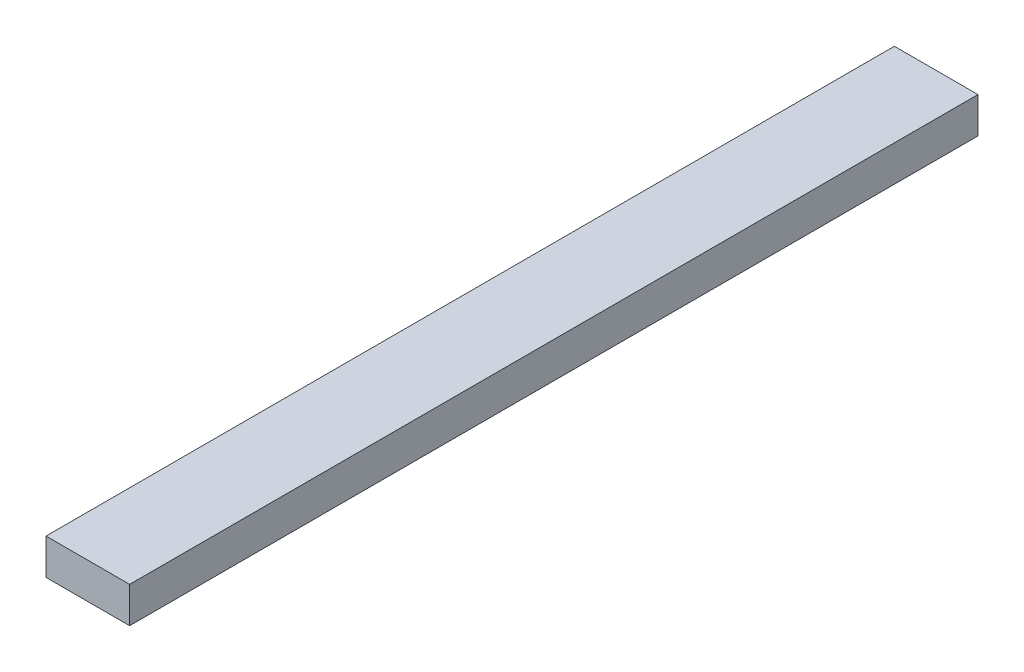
ISO-10303-21;
HEADER;
FILE_DESCRIPTION(('STEP AP214'),'2;1');
FILE_NAME('part.step','',(''),(''),'','','');
FILE_SCHEMA(('AUTOMOTIVE_DESIGN { 1 0 10303 214 1 1 1 1 }'));
ENDSEC;
DATA;
#1=APPLICATION_CONTEXT('core data for automotive mechanical design processes');
#2=APPLICATION_PROTOCOL_DEFINITION('international standard','automotive_design',2000,#1);
#3=PRODUCT_CONTEXT('',#1,'mechanical');
#4=PRODUCT('Part','Part','',(#3));
#5=PRODUCT_RELATED_PRODUCT_CATEGORY('part','',(#4));
#6=PRODUCT_DEFINITION_FORMATION('','',#4);
#7=PRODUCT_DEFINITION_CONTEXT('part definition',#1,'design');
#8=PRODUCT_DEFINITION('design','',#6,#7);
#9=PRODUCT_DEFINITION_SHAPE('','',#8);
#10=(LENGTH_UNIT() NAMED_UNIT(*) SI_UNIT(.MILLI.,.METRE.));
#11=(NAMED_UNIT(*) PLANE_ANGLE_UNIT() SI_UNIT($,.RADIAN.));
#12=(NAMED_UNIT(*) SI_UNIT($,.STERADIAN.) SOLID_ANGLE_UNIT());
#13=UNCERTAINTY_MEASURE_WITH_UNIT(LENGTH_MEASURE(1.E-05),#10,'distance_accuracy_value','');
#14=(GEOMETRIC_REPRESENTATION_CONTEXT(3) GLOBAL_UNCERTAINTY_ASSIGNED_CONTEXT((#13)) GLOBAL_UNIT_ASSIGNED_CONTEXT((#10,
#11,#12)) REPRESENTATION_CONTEXT('',''));
#15=CARTESIAN_POINT('',(0.,0.,0.));
#16=DIRECTION('',(0.,0.,1.));
#17=DIRECTION('',(1.,0.,0.));
#18=AXIS2_PLACEMENT_3D('',#15,#16,#17);
#19=CARTESIAN_POINT('',(-88.9,38.1,0.));
#20=DIRECTION('',(0.,0.,1.));
#21=DIRECTION('',(1.,0.,0.));
#22=AXIS2_PLACEMENT_3D('',#19,#20,#21);
#23=PLANE('',#22);
#24=DIRECTION('',(-1.,0.,0.));
#25=VECTOR('',#24,1.);
#26=CARTESIAN_POINT('',(-88.9,0.,0.));
#27=LINE('',#26,#25);
#28=CARTESIAN_POINT('',(0.,0.,0.));
#29=VERTEX_POINT('',#28);
#30=CARTESIAN_POINT('',(-88.9,0.,0.));
#31=VERTEX_POINT('',#30);
#32=EDGE_CURVE('E96',#29,#31,#27,.T.);
#33=ORIENTED_EDGE('',*,*,#32,.T.);
#34=DIRECTION('',(0.,-1.,0.));
#35=VECTOR('',#34,1.);
#36=CARTESIAN_POINT('',(-88.9,38.1,0.));
#37=LINE('',#36,#35);
#38=CARTESIAN_POINT('',(-88.9,38.1,0.));
#39=VERTEX_POINT('',#38);
#40=EDGE_CURVE('E11',#39,#31,#37,.T.);
#41=ORIENTED_EDGE('',*,*,#40,.F.);
#42=DIRECTION('',(-1.,0.,0.));
#43=VECTOR('',#42,1.);
#44=CARTESIAN_POINT('',(-88.9,38.1,0.));
#45=LINE('',#44,#43);
#46=CARTESIAN_POINT('',(0.,38.1,0.));
#47=VERTEX_POINT('',#46);
#48=EDGE_CURVE('E84',#47,#39,#45,.T.);
#49=ORIENTED_EDGE('',*,*,#48,.F.);
#50=DIRECTION('',(0.,-1.,0.));
#51=VECTOR('',#50,1.);
#52=CARTESIAN_POINT('',(0.,38.1,0.));
#53=LINE('',#52,#51);
#54=EDGE_CURVE('E92',#47,#29,#53,.T.);
#55=ORIENTED_EDGE('',*,*,#54,.T.);
#56=EDGE_LOOP('',(#33,#41,#49,#55));
#57=FACE_BOUND('',#56,.T.);
#58=ADVANCED_FACE('F33',(#57),#23,.F.);
#59=CARTESIAN_POINT('',(-88.9,38.1,901.7));
#60=DIRECTION('',(1.,0.,0.));
#61=DIRECTION('',(0.,0.,-1.));
#62=AXIS2_PLACEMENT_3D('',#59,#60,#61);
#63=PLANE('',#62);
#64=DIRECTION('',(0.,0.,1.));
#65=VECTOR('',#64,1.);
#66=CARTESIAN_POINT('',(-88.9,0.,901.7));
#67=LINE('',#66,#65);
#68=CARTESIAN_POINT('',(-88.9,0.,901.7));
#69=VERTEX_POINT('',#68);
#70=EDGE_CURVE('E88',#31,#69,#67,.T.);
#71=ORIENTED_EDGE('',*,*,#70,.T.);
#72=DIRECTION('',(0.,-1.,0.));
#73=VECTOR('',#72,1.);
#74=CARTESIAN_POINT('',(-88.9,38.1,901.7));
#75=LINE('',#74,#73);
#76=CARTESIAN_POINT('',(-88.9,38.1,901.7));
#77=VERTEX_POINT('',#76);
#78=EDGE_CURVE('E41',#77,#69,#75,.T.);
#79=ORIENTED_EDGE('',*,*,#78,.F.);
#80=DIRECTION('',(0.,0.,1.));
#81=VECTOR('',#80,1.);
#82=CARTESIAN_POINT('',(-88.9,38.1,901.7));
#83=LINE('',#82,#81);
#84=EDGE_CURVE('E79',#39,#77,#83,.T.);
#85=ORIENTED_EDGE('',*,*,#84,.F.);
#86=ORIENTED_EDGE('',*,*,#40,.T.);
#87=EDGE_LOOP('',(#71,#79,#85,#86));
#88=FACE_BOUND('',#87,.T.);
#89=ADVANCED_FACE('F87',(#88),#63,.F.);
#90=CARTESIAN_POINT('',(1.10426401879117E-13,38.1,901.7));
#91=DIRECTION('',(0.,0.,-1.));
#92=DIRECTION('',(-1.,0.,0.));
#93=AXIS2_PLACEMENT_3D('',#90,#91,#92);
#94=PLANE('',#93);
#95=DIRECTION('',(1.,0.,0.));
#96=VECTOR('',#95,1.);
#97=CARTESIAN_POINT('',(1.10426401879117E-13,0.,901.7));
#98=LINE('',#97,#96);
#99=CARTESIAN_POINT('',(1.10426401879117E-13,0.,901.7));
#100=VERTEX_POINT('',#99);
#101=EDGE_CURVE('E66',#69,#100,#98,.T.);
#102=ORIENTED_EDGE('',*,*,#101,.T.);
#103=DIRECTION('',(0.,-1.,0.));
#104=VECTOR('',#103,1.);
#105=CARTESIAN_POINT('',(1.10426401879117E-13,38.1,901.7));
#106=LINE('',#105,#104);
#107=CARTESIAN_POINT('',(1.10426401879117E-13,38.1,901.7));
#108=VERTEX_POINT('',#107);
#109=EDGE_CURVE('E89',#108,#100,#106,.T.);
#110=ORIENTED_EDGE('',*,*,#109,.F.);
#111=DIRECTION('',(1.,0.,0.));
#112=VECTOR('',#111,1.);
#113=CARTESIAN_POINT('',(1.10426401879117E-13,38.1,901.7));
#114=LINE('',#113,#112);
#115=EDGE_CURVE('E82',#77,#108,#114,.T.);
#116=ORIENTED_EDGE('',*,*,#115,.F.);
#117=ORIENTED_EDGE('',*,*,#78,.T.);
#118=EDGE_LOOP('',(#102,#110,#116,#117));
#119=FACE_BOUND('',#118,.T.);
#120=ADVANCED_FACE('F90',(#119),#94,.F.);
#121=CARTESIAN_POINT('',(0.,38.1,0.));
#122=DIRECTION('',(-1.,0.,0.));
#123=DIRECTION('',(0.,0.,1.));
#124=AXIS2_PLACEMENT_3D('',#121,#122,#123);
#125=PLANE('',#124);
#126=DIRECTION('',(0.,0.,-1.));
#127=VECTOR('',#126,1.);
#128=CARTESIAN_POINT('',(0.,0.,0.));
#129=LINE('',#128,#127);
#130=EDGE_CURVE('E72',#100,#29,#129,.T.);
#131=ORIENTED_EDGE('',*,*,#130,.T.);
#132=ORIENTED_EDGE('',*,*,#54,.F.);
#133=DIRECTION('',(0.,0.,-1.));
#134=VECTOR('',#133,1.);
#135=CARTESIAN_POINT('',(0.,38.1,0.));
#136=LINE('',#135,#134);
#137=EDGE_CURVE('E49',#108,#47,#136,.T.);
#138=ORIENTED_EDGE('',*,*,#137,.F.);
#139=ORIENTED_EDGE('',*,*,#109,.T.);
#140=EDGE_LOOP('',(#131,#132,#138,#139));
#141=FACE_BOUND('',#140,.T.);
#142=ADVANCED_FACE('F103',(#141),#125,.F.);
#143=CARTESIAN_POINT('',(0.,38.1,0.));
#144=DIRECTION('',(0.,-1.,0.));
#145=DIRECTION('',(0.,0.,-1.));
#146=AXIS2_PLACEMENT_3D('',#143,#144,#145);
#147=PLANE('',#146);
#148=ORIENTED_EDGE('',*,*,#48,.T.);
#149=ORIENTED_EDGE('',*,*,#84,.T.);
#150=ORIENTED_EDGE('',*,*,#115,.T.);
#151=ORIENTED_EDGE('',*,*,#137,.T.);
#152=EDGE_LOOP('',(#148,#149,#150,#151));
#153=FACE_BOUND('',#152,.T.);
#154=ADVANCED_FACE('F80',(#153),#147,.F.);
#155=CARTESIAN_POINT('',(0.,0.,0.));
#156=DIRECTION('',(0.,-1.,0.));
#157=DIRECTION('',(0.,0.,-1.));
#158=AXIS2_PLACEMENT_3D('',#155,#156,#157);
#159=PLANE('',#158);
#160=ORIENTED_EDGE('',*,*,#32,.F.);
#161=ORIENTED_EDGE('',*,*,#130,.F.);
#162=ORIENTED_EDGE('',*,*,#101,.F.);
#163=ORIENTED_EDGE('',*,*,#70,.F.);
#164=EDGE_LOOP('',(#160,#161,#162,#163));
#165=FACE_BOUND('',#164,.T.);
#166=ADVANCED_FACE('F106',(#165),#159,.T.);
#167=CLOSED_SHELL('',(#58,#89,#120,#142,#154,#166));
#168=MANIFOLD_SOLID_BREP('B2',#167);
#169=ADVANCED_BREP_SHAPE_REPRESENTATION('',(#18,#168),#14);
#170=SHAPE_DEFINITION_REPRESENTATION(#9,#169);
ENDSEC;
END-ISO-10303-21;
